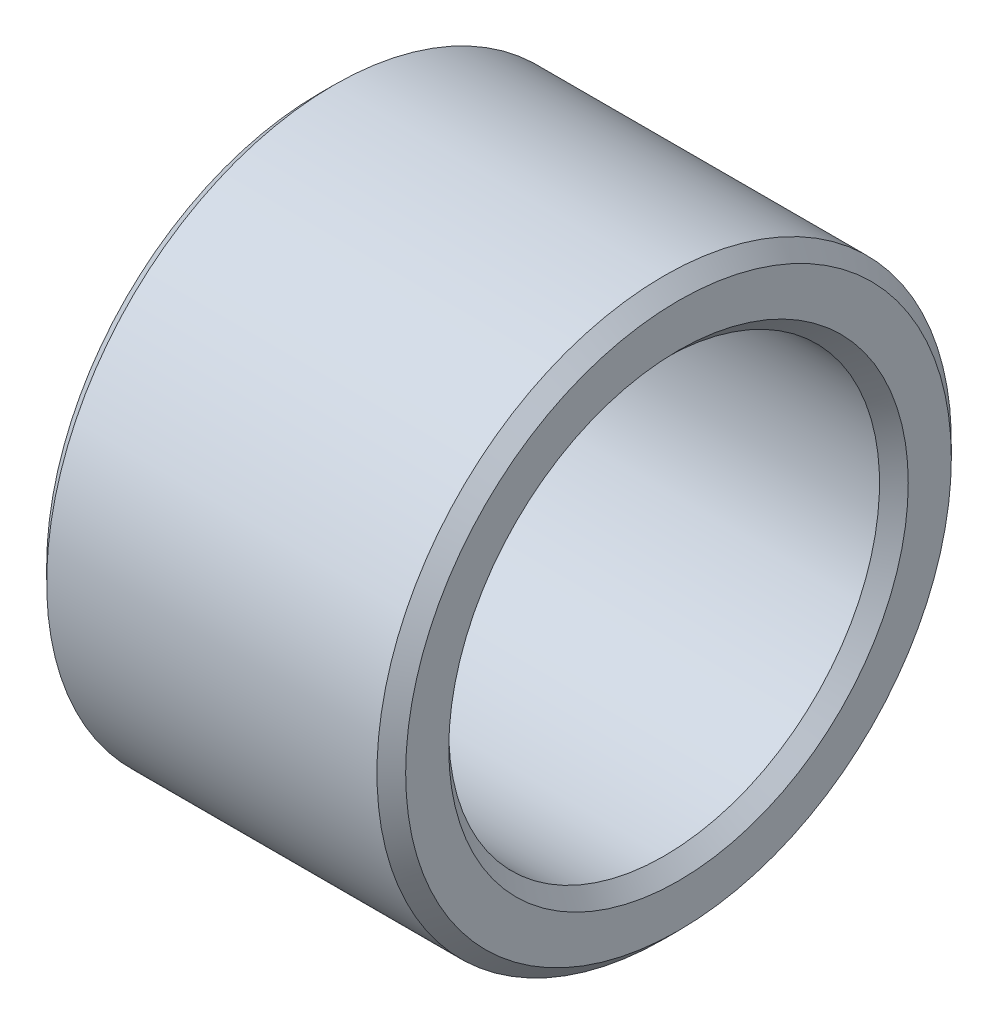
ISO-10303-21;
HEADER;
FILE_DESCRIPTION(('STEP AP214'),'2;1');
FILE_NAME('part.step','',(''),(''),'','','');
FILE_SCHEMA(('AUTOMOTIVE_DESIGN { 1 0 10303 214 1 1 1 1 }'));
ENDSEC;
DATA;
#1=APPLICATION_CONTEXT('core data for automotive mechanical design processes');
#2=APPLICATION_PROTOCOL_DEFINITION('international standard','automotive_design',2000,#1);
#3=PRODUCT_CONTEXT('',#1,'mechanical');
#4=PRODUCT('Part','Part','',(#3));
#5=PRODUCT_RELATED_PRODUCT_CATEGORY('part','',(#4));
#6=PRODUCT_DEFINITION_FORMATION('','',#4);
#7=PRODUCT_DEFINITION_CONTEXT('part definition',#1,'design');
#8=PRODUCT_DEFINITION('design','',#6,#7);
#9=PRODUCT_DEFINITION_SHAPE('','',#8);
#10=(LENGTH_UNIT() NAMED_UNIT(*) SI_UNIT(.MILLI.,.METRE.));
#11=(NAMED_UNIT(*) PLANE_ANGLE_UNIT() SI_UNIT($,.RADIAN.));
#12=(NAMED_UNIT(*) SI_UNIT($,.STERADIAN.) SOLID_ANGLE_UNIT());
#13=UNCERTAINTY_MEASURE_WITH_UNIT(LENGTH_MEASURE(1.E-05),#10,'distance_accuracy_value','');
#14=(GEOMETRIC_REPRESENTATION_CONTEXT(3) GLOBAL_UNCERTAINTY_ASSIGNED_CONTEXT((#13)) GLOBAL_UNIT_ASSIGNED_CONTEXT((#10,
#11,#12)) REPRESENTATION_CONTEXT('',''));
#15=CARTESIAN_POINT('',(0.,0.,0.));
#16=DIRECTION('',(0.,0.,1.));
#17=DIRECTION('',(1.,0.,0.));
#18=AXIS2_PLACEMENT_3D('',#15,#16,#17);
#19=CARTESIAN_POINT('',(0.,-7.,0.));
#20=DIRECTION('',(-1.,0.,0.));
#21=DIRECTION('',(0.,1.,0.));
#22=AXIS2_PLACEMENT_3D('',#19,#20,#21);
#23=PLANE('',#22);
#24=CARTESIAN_POINT('',(0.,0.,0.));
#25=DIRECTION('',(1.,0.,0.));
#26=DIRECTION('',(0.,-1.,0.));
#27=AXIS2_PLACEMENT_3D('',#24,#25,#26);
#28=CIRCLE('',#27,6.4);
#29=CARTESIAN_POINT('',(0.,-6.4,0.));
#30=VERTEX_POINT('',#29);
#31=EDGE_CURVE('E10',#30,#30,#28,.T.);
#32=ORIENTED_EDGE('',*,*,#31,.T.);
#33=EDGE_LOOP('',(#32));
#34=FACE_BOUND('',#33,.T.);
#35=CARTESIAN_POINT('',(0.,0.,0.));
#36=DIRECTION('',(1.,0.,0.));
#37=DIRECTION('',(0.,-1.,0.));
#38=AXIS2_PLACEMENT_3D('',#35,#36,#37);
#39=CIRCLE('',#38,7.6);
#40=CARTESIAN_POINT('',(0.,-7.6,0.));
#41=VERTEX_POINT('',#40);
#42=EDGE_CURVE('E54',#41,#41,#39,.T.);
#43=ORIENTED_EDGE('',*,*,#42,.F.);
#44=EDGE_LOOP('',(#43));
#45=FACE_BOUND('',#44,.T.);
#46=ADVANCED_FACE('F16',(#34,#45),#23,.T.);
#47=CARTESIAN_POINT('',(0.2,0.,0.));
#48=DIRECTION('',(-1.,0.,0.));
#49=DIRECTION('',(0.,-1.,0.));
#50=AXIS2_PLACEMENT_3D('',#47,#48,#49);
#51=CONICAL_SURFACE('',#50,6.2,0.785398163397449);
#52=CARTESIAN_POINT('',(0.4,0.,0.));
#53=DIRECTION('',(1.,0.,0.));
#54=DIRECTION('',(0.,-1.,0.));
#55=AXIS2_PLACEMENT_3D('',#52,#53,#54);
#56=CIRCLE('',#55,6.);
#57=CARTESIAN_POINT('',(0.4,-6.,0.));
#58=VERTEX_POINT('',#57);
#59=EDGE_CURVE('E23',#58,#58,#56,.T.);
#60=ORIENTED_EDGE('',*,*,#59,.T.);
#61=EDGE_LOOP('',(#60));
#62=FACE_BOUND('',#61,.T.);
#63=ORIENTED_EDGE('',*,*,#31,.F.);
#64=EDGE_LOOP('',(#63));
#65=FACE_BOUND('',#64,.T.);
#66=ADVANCED_FACE('F83',(#62,#65),#51,.F.);
#67=CARTESIAN_POINT('',(5.,0.,0.));
#68=DIRECTION('',(-1.,0.,0.));
#69=DIRECTION('',(0.,-1.,0.));
#70=AXIS2_PLACEMENT_3D('',#67,#68,#69);
#71=CYLINDRICAL_SURFACE('',#70,6.);
#72=CARTESIAN_POINT('',(9.6,0.,0.));
#73=DIRECTION('',(1.,0.,0.));
#74=DIRECTION('',(0.,-1.,0.));
#75=AXIS2_PLACEMENT_3D('',#72,#73,#74);
#76=CIRCLE('',#75,6.);
#77=CARTESIAN_POINT('',(9.6,-6.,0.));
#78=VERTEX_POINT('',#77);
#79=EDGE_CURVE('E59',#78,#78,#76,.T.);
#80=ORIENTED_EDGE('',*,*,#79,.T.);
#81=EDGE_LOOP('',(#80));
#82=FACE_BOUND('',#81,.T.);
#83=ORIENTED_EDGE('',*,*,#59,.F.);
#84=EDGE_LOOP('',(#83));
#85=FACE_BOUND('',#84,.T.);
#86=ADVANCED_FACE('F67',(#82,#85),#71,.F.);
#87=CARTESIAN_POINT('',(9.8,0.,0.));
#88=DIRECTION('',(1.,0.,0.));
#89=DIRECTION('',(0.,-1.,0.));
#90=AXIS2_PLACEMENT_3D('',#87,#88,#89);
#91=CONICAL_SURFACE('',#90,6.2,0.785398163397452);
#92=CARTESIAN_POINT('',(10.,0.,0.));
#93=DIRECTION('',(1.,0.,0.));
#94=DIRECTION('',(0.,-1.,0.));
#95=AXIS2_PLACEMENT_3D('',#92,#93,#94);
#96=CIRCLE('',#95,6.4);
#97=CARTESIAN_POINT('',(10.,-6.4,0.));
#98=VERTEX_POINT('',#97);
#99=EDGE_CURVE('E64',#98,#98,#96,.T.);
#100=ORIENTED_EDGE('',*,*,#99,.T.);
#101=EDGE_LOOP('',(#100));
#102=FACE_BOUND('',#101,.T.);
#103=ORIENTED_EDGE('',*,*,#79,.F.);
#104=EDGE_LOOP('',(#103));
#105=FACE_BOUND('',#104,.T.);
#106=ADVANCED_FACE('F70',(#102,#105),#91,.F.);
#107=CARTESIAN_POINT('',(10.,-7.,0.));
#108=DIRECTION('',(1.,0.,0.));
#109=DIRECTION('',(0.,-1.,0.));
#110=AXIS2_PLACEMENT_3D('',#107,#108,#109);
#111=PLANE('',#110);
#112=CARTESIAN_POINT('',(10.,0.,0.));
#113=DIRECTION('',(1.,0.,0.));
#114=DIRECTION('',(0.,-1.,0.));
#115=AXIS2_PLACEMENT_3D('',#112,#113,#114);
#116=CIRCLE('',#115,7.6);
#117=CARTESIAN_POINT('',(10.,-7.6,0.));
#118=VERTEX_POINT('',#117);
#119=EDGE_CURVE('E62',#118,#118,#116,.T.);
#120=ORIENTED_EDGE('',*,*,#119,.T.);
#121=EDGE_LOOP('',(#120));
#122=FACE_BOUND('',#121,.T.);
#123=ORIENTED_EDGE('',*,*,#99,.F.);
#124=EDGE_LOOP('',(#123));
#125=FACE_BOUND('',#124,.T.);
#126=ADVANCED_FACE('F72',(#122,#125),#111,.T.);
#127=CARTESIAN_POINT('',(9.8,0.,0.));
#128=DIRECTION('',(-1.,0.,0.));
#129=DIRECTION('',(0.,-1.,0.));
#130=AXIS2_PLACEMENT_3D('',#127,#128,#129);
#131=CONICAL_SURFACE('',#130,7.8,0.785398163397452);
#132=CARTESIAN_POINT('',(9.6,0.,0.));
#133=DIRECTION('',(1.,0.,0.));
#134=DIRECTION('',(0.,-1.,0.));
#135=AXIS2_PLACEMENT_3D('',#132,#133,#134);
#136=CIRCLE('',#135,8.);
#137=CARTESIAN_POINT('',(9.6,-8.,0.));
#138=VERTEX_POINT('',#137);
#139=EDGE_CURVE('E56',#138,#138,#136,.T.);
#140=ORIENTED_EDGE('',*,*,#139,.T.);
#141=EDGE_LOOP('',(#140));
#142=FACE_BOUND('',#141,.T.);
#143=ORIENTED_EDGE('',*,*,#119,.F.);
#144=EDGE_LOOP('',(#143));
#145=FACE_BOUND('',#144,.T.);
#146=ADVANCED_FACE('F80',(#142,#145),#131,.T.);
#147=CARTESIAN_POINT('',(5.,0.,0.));
#148=DIRECTION('',(-1.,0.,0.));
#149=DIRECTION('',(0.,-1.,0.));
#150=AXIS2_PLACEMENT_3D('',#147,#148,#149);
#151=CYLINDRICAL_SURFACE('',#150,8.);
#152=CARTESIAN_POINT('',(0.4,0.,0.));
#153=DIRECTION('',(1.,0.,0.));
#154=DIRECTION('',(0.,-1.,0.));
#155=AXIS2_PLACEMENT_3D('',#152,#153,#154);
#156=CIRCLE('',#155,8.);
#157=CARTESIAN_POINT('',(0.4,-8.,0.));
#158=VERTEX_POINT('',#157);
#159=EDGE_CURVE('E50',#158,#158,#156,.T.);
#160=ORIENTED_EDGE('',*,*,#159,.T.);
#161=EDGE_LOOP('',(#160));
#162=FACE_BOUND('',#161,.T.);
#163=ORIENTED_EDGE('',*,*,#139,.F.);
#164=EDGE_LOOP('',(#163));
#165=FACE_BOUND('',#164,.T.);
#166=ADVANCED_FACE('F51',(#162,#165),#151,.T.);
#167=CARTESIAN_POINT('',(0.2,0.,0.));
#168=DIRECTION('',(1.,0.,0.));
#169=DIRECTION('',(0.,-1.,0.));
#170=AXIS2_PLACEMENT_3D('',#167,#168,#169);
#171=CONICAL_SURFACE('',#170,7.8,0.785398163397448);
#172=ORIENTED_EDGE('',*,*,#42,.T.);
#173=EDGE_LOOP('',(#172));
#174=FACE_BOUND('',#173,.T.);
#175=ORIENTED_EDGE('',*,*,#159,.F.);
#176=EDGE_LOOP('',(#175));
#177=FACE_BOUND('',#176,.T.);
#178=ADVANCED_FACE('F93',(#174,#177),#171,.T.);
#179=CLOSED_SHELL('',(#46,#66,#86,#106,#126,#146,#166,#178));
#180=MANIFOLD_SOLID_BREP('B1',#179);
#181=ADVANCED_BREP_SHAPE_REPRESENTATION('',(#18,#180),#14);
#182=SHAPE_DEFINITION_REPRESENTATION(#9,#181);
ENDSEC;
END-ISO-10303-21;
